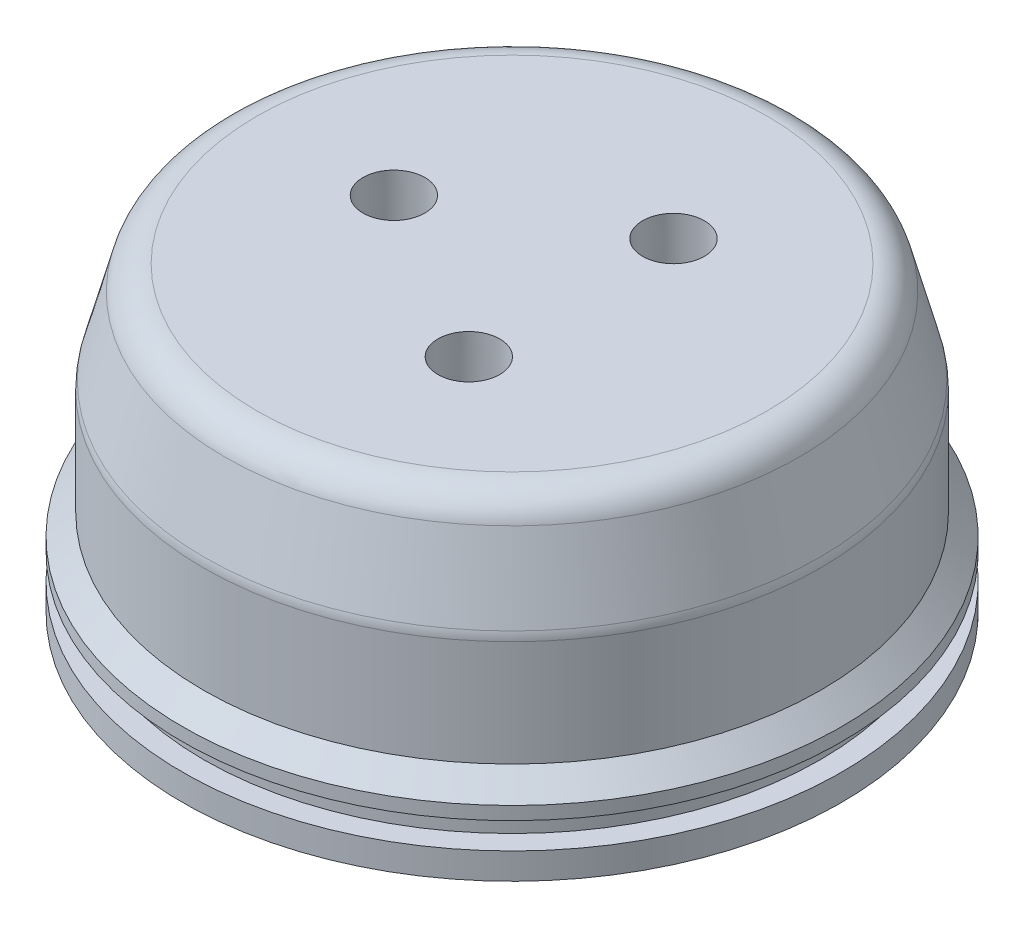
from build123d import *

# Parameters (mm, degrees)
CIRPATTERN1_COUNT = 3
FILLET1_R         = 6.35


with BuildPart() as part:
    # Sketch1 → Revolve1 (revolve)
    with BuildSketch(Plane.XY, mode=Mode.PRIVATE) as revolve1_sk:
        Polygon((-63.754, 0), (-63.754, 5.08), (-59.619490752, 5.08), (-59.619490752, 10.16), (-63.754, 10.16), (-63.754, 12.7), (-59.69, 16.764), (-59.69, 38.1), (-54.24527241, 58.42), (0, 58.42), (0, 49.53), (-50.8, 49.53), (-50.8, 0), align=None)
    revolve(revolve1_sk.sketch.rotate(Axis((0, 0, 0), (0, 1, 0)), 270), axis=Axis((0, 0, 0), (0, 1, 0)))

    # Sketch2 → 1_4 NPT Tapped Hole1 (revolve, cut)
    with BuildSketch(Plane(origin=(-22.86, 49.53, 0), x_dir=(0, 0, -1), z_dir=(1, 0, 0))):
        Polygon((0, 0), (0, 8.89), (5.5626, 8.89), (5.5626, 10.033), (5.943680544, 10.033), (6.244082, 0), align=None)
    f_1_4_npt_tapped_hole1 = revolve(axis=Axis((-22.86, 43.18, 0), (0, 1, 0)), mode=Mode.SUBTRACT)

    # CirPattern1: 1_4 NPT Tapped Hole1 ×3 about axis
    cirpattern1_axis = Axis((0, 0, 0), (0, 1, 0))
    for i in range(1, CIRPATTERN1_COUNT):
        add(f_1_4_npt_tapped_hole1.rotate(cirpattern1_axis, i * 360 / CIRPATTERN1_COUNT), mode=Mode.SUBTRACT)

    # Fillet1
    fillet1_edges = [part.edges().sort_by_distance(p)[0] for p in [
        (0, 49.53, 50.8),
        (0, 58.42, 54.24527241),
        (0, 38.1, 59.69),
    ]]
    fillet(fillet1_edges, radius=FILLET1_R)


solid = part.part
